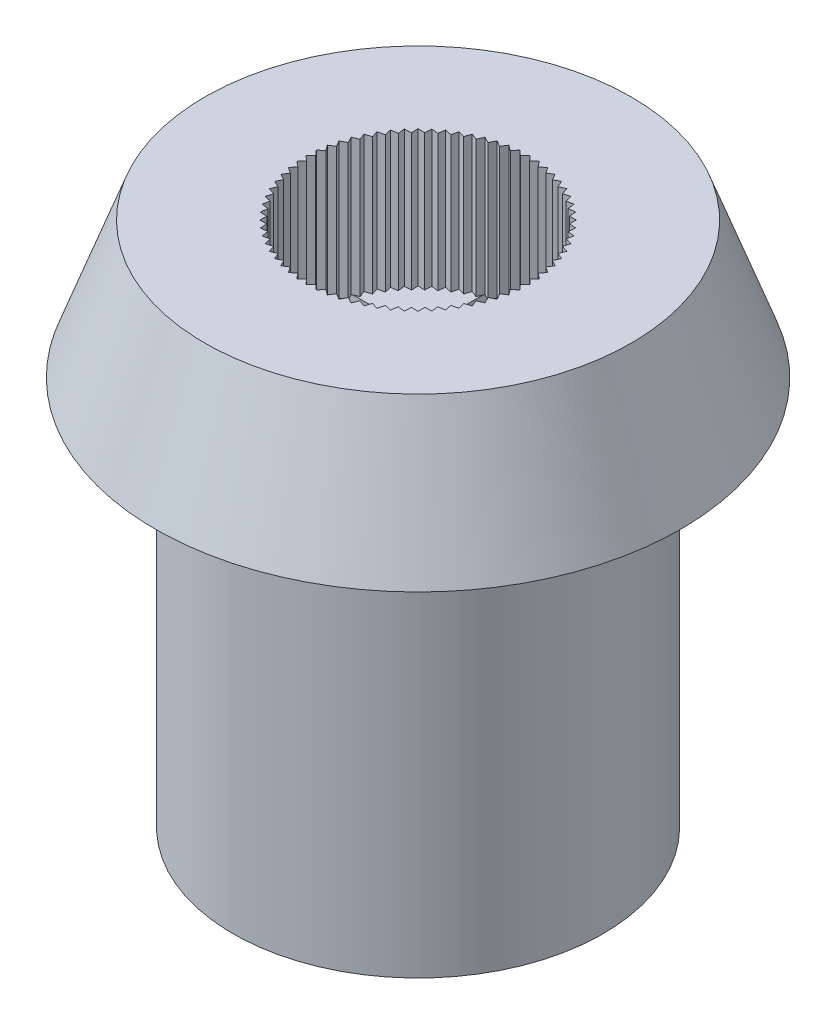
from build123d import *

# Parameters (mm, degrees)
AUFSATZ_LINEAR_AUSTRAGEN3_DEPTH = 2.8
SCHNITT_LINEAR_AUSTRAGEN1_DEPTH = 8


with BuildPart() as part:
    # Skizze1 → Rotation1 (revolve)
    with BuildSketch(Plane.XY, mode=Mode.PRIVATE) as rotation1_sk:
        Polygon((-2.3, 0), (-4.380883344, 0), (-5.4, -2.8), (-3.8, -2.8), (-3.8, -10.8), (0, -10.8), (0, -2.8), (-2.3, -2.8), align=None)
    revolve(rotation1_sk.sketch.rotate(Axis((0, 0, 0), (0, 1, 0)), 270), axis=Axis((0, 0, 0), (0, 1, 0)))

    # Skizze2 → Aufsatz-Linear austragen3 (add)
    with BuildSketch(Plane(origin=(0, 0, 0), x_dir=(1, 0, 0), z_dir=(0, 1, 0))):
        with BuildLine():
            Line((-2.181178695, -0.287157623), (-2.291247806, -0.200458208))
            ThreePointArc((-2.291247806, -0.200458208), (-2.280323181, -0.300210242), (-2.265057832, -0.399390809))
            Line((-2.265057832, -0.399390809), (-2.181178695, -0.287157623))
        make_face()
        with BuildLine():
            Line((-2.098177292, -0.661552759), (-2.2216294, -0.595283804))
            ThreePointArc((-2.2216294, -0.595283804), (-2.193548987, -0.691623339), (-2.161293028, -0.78664633))
            Line((-2.161293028, -0.78664633), (-2.098177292, -0.661552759))
        make_face()
        with BuildLine():
            Line((-2.032534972, -0.841903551), (-2.161293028, -0.78664633))
            ThreePointArc((-2.161293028, -0.78664633), (-2.124922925, -0.880171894), (-2.08450791, -0.972022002))
            Line((-2.08450791, -0.972022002), (-2.032534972, -0.841903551))
        make_face()
        with BuildLine():
            Line((-1.855461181, -1.182059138), (-1.991858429, -1.15))
            ThreePointArc((-1.991858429, -1.15), (-1.939800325, -1.235789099), (-1.884049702, -1.319225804))
            Line((-1.884049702, -1.319225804), (-1.855461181, -1.182059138))
        make_face()
        with BuildLine():
            Line((-1.745377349, -1.339275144), (-1.884049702, -1.319225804))
            ThreePointArc((-1.884049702, -1.319225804), (-1.824712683, -1.400151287), (-1.761902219, -1.478411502))
            Line((-1.761902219, -1.478411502), (-1.745377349, -1.339275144))
        make_face()
        with BuildLine():
            Line((-1.622010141, -1.486298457), (-1.761902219, -1.478411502))
            ThreePointArc((-1.761902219, -1.478411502), (-1.695737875, -1.553857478), (-1.626345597, -1.626345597))
            Line((-1.626345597, -1.626345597), (-1.622010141, -1.486298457))
        make_face()
        with BuildLine():
            Line((-1.339275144, -1.745377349), (-1.478411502, -1.761902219))
            ThreePointArc((-1.478411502, -1.761902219), (-1.400151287, -1.824712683), (-1.319225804, -1.884049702))
            Line((-1.319225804, -1.884049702), (-1.339275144, -1.745377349))
        make_face()
        with BuildLine():
            Line((-0.841903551, -2.032534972), (-0.972022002, -2.08450791))
            ThreePointArc((-0.972022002, -2.08450791), (-0.880171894, -2.124922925), (-0.78664633, -2.161293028))
            Line((-0.78664633, -2.161293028), (-0.841903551, -2.032534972))
        make_face()
        with BuildLine():
            Line((-0.661552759, -2.098177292), (-0.78664633, -2.161293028))
            ThreePointArc((-0.78664633, -2.161293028), (-0.691623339, -2.193548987), (-0.595283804, -2.2216294))
            Line((-0.595283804, -2.2216294), (-0.661552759, -2.098177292))
        make_face()
        with BuildLine():
            Line((-0.476167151, -2.147851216), (-0.595283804, -2.2216294))
            ThreePointArc((-0.595283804, -2.2216294), (-0.497811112, -2.245480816), (-0.399390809, -2.265057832))
            Line((-0.399390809, -2.265057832), (-0.476167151, -2.147851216))
        make_face()
        with BuildLine():
            Line((-0.287157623, -2.181178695), (-0.399390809, -2.265057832))
            ThreePointArc((-0.399390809, -2.265057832), (-0.300210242, -2.280323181), (-0.200458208, -2.291247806))
            Line((-0.200458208, -2.291247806), (-0.287157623, -2.181178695))
        make_face()
        with BuildLine():
            Line((-0.095962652, -2.197906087), (-0.200458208, -2.291247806))
            ThreePointArc((-0.200458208, -2.291247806), (-0.100324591, -2.29781091), (0, -2.3))
            Line((0, -2.3), (-0.095962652, -2.197906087))
        make_face()
        with BuildLine():
            Line((0.095962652, -2.197906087), (0, -2.3))
            ThreePointArc((0, -2.3), (0.100324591, -2.29781091), (0.200458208, -2.291247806))
            Line((0.200458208, -2.291247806), (0.095962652, -2.197906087))
        make_face()
        with BuildLine():
            Line((0.287157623, -2.181178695), (0.200458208, -2.291247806))
            ThreePointArc((0.200458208, -2.291247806), (0.300210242, -2.280323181), (0.399390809, -2.265057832))
            Line((0.399390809, -2.265057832), (0.287157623, -2.181178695))
        make_face()
        with BuildLine():
            Line((0.476167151, -2.147851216), (0.399390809, -2.265057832))
            ThreePointArc((0.399390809, -2.265057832), (0.497811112, -2.245480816), (0.595283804, -2.2216294))
            Line((0.595283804, -2.2216294), (0.476167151, -2.147851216))
        make_face()
        with BuildLine():
            Line((0.661552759, -2.098177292), (0.595283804, -2.2216294))
            ThreePointArc((0.595283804, -2.2216294), (0.691623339, -2.193548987), (0.78664633, -2.161293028))
            Line((0.78664633, -2.161293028), (0.661552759, -2.098177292))
        make_face()
        with BuildLine():
            Line((0.841903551, -2.032534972), (0.78664633, -2.161293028))
            ThreePointArc((0.78664633, -2.161293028), (0.880171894, -2.124922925), (0.972022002, -2.08450791))
            Line((0.972022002, -2.08450791), (0.841903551, -2.032534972))
        make_face()
        with BuildLine():
            Line((1.015846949, -1.951423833), (0.972022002, -2.08450791))
            ThreePointArc((0.972022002, -2.08450791), (1.06202181, -2.040124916), (1.15, -1.991858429))
            Line((1.15, -1.991858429), (1.015846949, -1.951423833))
        make_face()
        with BuildLine():
            Line((1.182059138, -1.855461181), (1.15, -1.991858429))
            ThreePointArc((1.15, -1.991858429), (1.235789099, -1.939800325), (1.319225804, -1.884049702))
            Line((1.319225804, -1.884049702), (1.182059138, -1.855461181))
        make_face()
        with BuildLine():
            Line((1.486298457, -1.622010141), (1.478411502, -1.761902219))
            ThreePointArc((1.478411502, -1.761902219), (1.553857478, -1.695737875), (1.626345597, -1.626345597))
            Line((1.626345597, -1.626345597), (1.486298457, -1.622010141))
        make_face()
        with BuildLine():
            Line((1.622010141, -1.486298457), (1.626345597, -1.626345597))
            ThreePointArc((1.626345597, -1.626345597), (1.695737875, -1.553857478), (1.761902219, -1.478411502))
            Line((1.761902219, -1.478411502), (1.622010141, -1.486298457))
        make_face()
        with BuildLine():
            Line((1.855461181, -1.182059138), (1.884049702, -1.319225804))
            ThreePointArc((1.884049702, -1.319225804), (1.939800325, -1.235789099), (1.991858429, -1.15))
            Line((1.991858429, -1.15), (1.855461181, -1.182059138))
        make_face()
        with BuildLine():
            Line((1.951423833, -1.015846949), (1.991858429, -1.15))
            ThreePointArc((1.991858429, -1.15), (2.040124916, -1.06202181), (2.08450791, -0.972022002))
            Line((2.08450791, -0.972022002), (1.951423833, -1.015846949))
        make_face()
        with BuildLine():
            Line((2.032534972, -0.841903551), (2.08450791, -0.972022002))
            ThreePointArc((2.08450791, -0.972022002), (2.124922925, -0.880171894), (2.161293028, -0.78664633))
            Line((2.161293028, -0.78664633), (2.032534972, -0.841903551))
        make_face()
        with BuildLine():
            Line((2.098177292, -0.661552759), (2.161293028, -0.78664633))
            ThreePointArc((2.161293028, -0.78664633), (2.193548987, -0.691623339), (2.2216294, -0.595283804))
            Line((2.2216294, -0.595283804), (2.098177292, -0.661552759))
        make_face()
        with BuildLine():
            Line((2.147851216, -0.476167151), (2.2216294, -0.595283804))
            ThreePointArc((2.2216294, -0.595283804), (2.245480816, -0.497811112), (2.265057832, -0.399390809))
            Line((2.265057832, -0.399390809), (2.147851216, -0.476167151))
        make_face()
        with BuildLine():
            Line((2.181178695, -0.287157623), (2.265057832, -0.399390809))
            ThreePointArc((2.265057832, -0.399390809), (2.280323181, -0.300210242), (2.291247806, -0.200458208))
            Line((2.291247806, -0.200458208), (2.181178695, -0.287157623))
        make_face()
        with BuildLine():
            ThreePointArc((2.291247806, -0.200458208), (2.29781091, -0.100324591), (2.3, 0))
            Line((2.3, 0), (2.197906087, -0.095962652))
            Line((2.197906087, -0.095962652), (2.291247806, -0.200458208))
        make_face()
        with BuildLine():
            ThreePointArc((2.3, 0), (2.29781091, 0.100324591), (2.291247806, 0.200458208))
            Line((2.291247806, 0.200458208), (2.197906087, 0.095962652))
            Line((2.197906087, 0.095962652), (2.3, 0))
        make_face()
        with BuildLine():
            ThreePointArc((2.265057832, 0.399390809), (2.245480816, 0.497811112), (2.2216294, 0.595283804))
            Line((2.2216294, 0.595283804), (2.147851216, 0.476167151))
            Line((2.147851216, 0.476167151), (2.265057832, 0.399390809))
        make_face()
        with BuildLine():
            ThreePointArc((2.161293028, 0.78664633), (2.124922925, 0.880171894), (2.08450791, 0.972022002))
            Line((2.08450791, 0.972022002), (2.032534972, 0.841903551))
            Line((2.032534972, 0.841903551), (2.161293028, 0.78664633))
        make_face()
        with BuildLine():
            ThreePointArc((1.761902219, 1.478411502), (1.695737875, 1.553857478), (1.626345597, 1.626345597))
            Line((1.626345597, 1.626345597), (1.622010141, 1.486298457))
            Line((1.622010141, 1.486298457), (1.761902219, 1.478411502))
        make_face()
        with BuildLine():
            ThreePointArc((1.626345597, 1.626345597), (1.553857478, 1.695737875), (1.478411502, 1.761902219))
            Line((1.478411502, 1.761902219), (1.486298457, 1.622010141))
            Line((1.486298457, 1.622010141), (1.626345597, 1.626345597))
        make_face()
        with BuildLine():
            ThreePointArc((0.972022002, 2.08450791), (0.880171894, 2.124922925), (0.78664633, 2.161293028))
            Line((0.78664633, 2.161293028), (0.841903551, 2.032534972))
            Line((0.841903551, 2.032534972), (0.972022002, 2.08450791))
        make_face()
        with BuildLine():
            ThreePointArc((0.78664633, 2.161293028), (0.691623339, 2.193548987), (0.595283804, 2.2216294))
            Line((0.595283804, 2.2216294), (0.661552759, 2.098177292))
            Line((0.661552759, 2.098177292), (0.78664633, 2.161293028))
        make_face()
        with BuildLine():
            ThreePointArc((0.595283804, 2.2216294), (0.497811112, 2.245480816), (0.399390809, 2.265057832))
            Line((0.399390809, 2.265057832), (0.476167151, 2.147851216))
            Line((0.476167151, 2.147851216), (0.595283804, 2.2216294))
        make_face()
        with BuildLine():
            ThreePointArc((0.399390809, 2.265057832), (0.300210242, 2.280323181), (0.200458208, 2.291247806))
            Line((0.200458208, 2.291247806), (0.287157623, 2.181178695))
            Line((0.287157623, 2.181178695), (0.399390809, 2.265057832))
        make_face()
        with BuildLine():
            ThreePointArc((0.200458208, 2.291247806), (0.100324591, 2.29781091), (0, 2.3))
            Line((0, 2.3), (0.095962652, 2.197906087))
            Line((0.095962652, 2.197906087), (0.200458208, 2.291247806))
        make_face()
        with BuildLine():
            ThreePointArc((0, 2.3), (-0.100324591, 2.29781091), (-0.200458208, 2.291247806))
            Line((-0.200458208, 2.291247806), (-0.095962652, 2.197906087))
            Line((-0.095962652, 2.197906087), (0, 2.3))
        make_face()
        with BuildLine():
            ThreePointArc((-0.200458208, 2.291247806), (-0.300210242, 2.280323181), (-0.399390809, 2.265057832))
            Line((-0.399390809, 2.265057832), (-0.287157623, 2.181178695))
            Line((-0.287157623, 2.181178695), (-0.200458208, 2.291247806))
        make_face()
        with BuildLine():
            ThreePointArc((-2.2216294, 0.595283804), (-2.245480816, 0.497811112), (-2.265057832, 0.399390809))
            Line((-2.265057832, 0.399390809), (-2.147851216, 0.476167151))
            Line((-2.147851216, 0.476167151), (-2.2216294, 0.595283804))
        make_face()
        with BuildLine():
            ThreePointArc((-2.161293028, 0.78664633), (-2.193548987, 0.691623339), (-2.2216294, 0.595283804))
            Line((-2.2216294, 0.595283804), (-2.098177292, 0.661552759))
            Line((-2.098177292, 0.661552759), (-2.161293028, 0.78664633))
        make_face()
        with BuildLine():
            ThreePointArc((-2.08450791, 0.972022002), (-2.124922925, 0.880171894), (-2.161293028, 0.78664633))
            Line((-2.161293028, 0.78664633), (-2.032534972, 0.841903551))
            Line((-2.032534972, 0.841903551), (-2.08450791, 0.972022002))
        make_face()
        with BuildLine():
            ThreePointArc((-1.478411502, 1.761902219), (-1.553857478, 1.695737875), (-1.626345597, 1.626345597))
            Line((-1.626345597, 1.626345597), (-1.486298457, 1.622010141))
            Line((-1.486298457, 1.622010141), (-1.478411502, 1.761902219))
        make_face()
        with BuildLine():
            ThreePointArc((-1.319225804, 1.884049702), (-1.400151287, 1.824712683), (-1.478411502, 1.761902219))
            Line((-1.478411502, 1.761902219), (-1.339275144, 1.745377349))
            Line((-1.339275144, 1.745377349), (-1.319225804, 1.884049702))
        make_face()
        with BuildLine():
            ThreePointArc((-1.15, 1.991858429), (-1.235789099, 1.939800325), (-1.319225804, 1.884049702))
            Line((-1.319225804, 1.884049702), (-1.182059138, 1.855461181))
            Line((-1.182059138, 1.855461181), (-1.15, 1.991858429))
        make_face()
        with BuildLine():
            ThreePointArc((-0.78664633, 2.161293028), (-0.880171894, 2.124922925), (-0.972022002, 2.08450791))
            Line((-0.972022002, 2.08450791), (-0.841903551, 2.032534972))
            Line((-0.841903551, 2.032534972), (-0.78664633, 2.161293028))
        make_face()
        with BuildLine():
            ThreePointArc((-0.595283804, 2.2216294), (-0.691623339, 2.193548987), (-0.78664633, 2.161293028))
            Line((-0.78664633, 2.161293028), (-0.661552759, 2.098177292))
            Line((-0.661552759, 2.098177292), (-0.595283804, 2.2216294))
        make_face()
        with BuildLine():
            ThreePointArc((-0.399390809, 2.265057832), (-0.497811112, 2.245480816), (-0.595283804, 2.2216294))
            Line((-0.595283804, 2.2216294), (-0.476167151, 2.147851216))
            Line((-0.476167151, 2.147851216), (-0.399390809, 2.265057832))
        make_face()
        with BuildLine():
            Line((-2.181178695, 0.287157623), (-2.291247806, 0.200458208))
            ThreePointArc((-2.291247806, 0.200458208), (-2.280323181, 0.300210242), (-2.265057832, 0.399390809))
            Line((-2.265057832, 0.399390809), (-2.181178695, 0.287157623))
        make_face()
        with BuildLine():
            ThreePointArc((-2.291247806, 0.200458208), (-2.29781091, 0.100324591), (-2.3, 0))
            Line((-2.3, 0), (-2.197906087, 0.095962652))
            Line((-2.197906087, 0.095962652), (-2.291247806, 0.200458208))
        make_face()
        with BuildLine():
            ThreePointArc((-2.3, 0), (-2.29781091, -0.100324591), (-2.291247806, -0.200458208))
            Line((-2.291247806, -0.200458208), (-2.197906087, -0.095962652))
            Line((-2.197906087, -0.095962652), (-2.3, 0))
        make_face()
        with BuildLine():
            ThreePointArc((-2.265057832, -0.399390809), (-2.245480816, -0.497811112), (-2.2216294, -0.595283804))
            Line((-2.2216294, -0.595283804), (-2.147851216, -0.476167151))
            Line((-2.147851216, -0.476167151), (-2.265057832, -0.399390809))
        make_face()
        with BuildLine():
            Line((-2.08450791, -0.972022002), (-1.951423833, -1.015846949))
            Line((-1.951423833, -1.015846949), (-1.991858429, -1.15))
            ThreePointArc((-1.991858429, -1.15), (-2.040124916, -1.06202181), (-2.08450791, -0.972022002))
        make_face()
        with BuildLine():
            Line((-1.486298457, -1.622010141), (-1.478411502, -1.761902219))
            ThreePointArc((-1.478411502, -1.761902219), (-1.553857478, -1.695737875), (-1.626345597, -1.626345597))
            Line((-1.626345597, -1.626345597), (-1.486298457, -1.622010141))
        make_face()
        with BuildLine():
            Line((-1.182059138, -1.855461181), (-1.15, -1.991858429))
            ThreePointArc((-1.15, -1.991858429), (-1.235789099, -1.939800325), (-1.319225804, -1.884049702))
            Line((-1.319225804, -1.884049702), (-1.182059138, -1.855461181))
        make_face()
        with BuildLine():
            Line((-1.15, -1.991858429), (-1.015846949, -1.951423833))
            Line((-1.015846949, -1.951423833), (-0.972022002, -2.08450791))
            ThreePointArc((-0.972022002, -2.08450791), (-1.06202181, -2.040124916), (-1.15, -1.991858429))
        make_face()
        with BuildLine():
            Line((1.339275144, -1.745377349), (1.478411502, -1.761902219))
            ThreePointArc((1.478411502, -1.761902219), (1.400151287, -1.824712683), (1.319225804, -1.884049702))
            Line((1.319225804, -1.884049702), (1.339275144, -1.745377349))
        make_face()
        with BuildLine():
            Line((1.761902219, -1.478411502), (1.745377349, -1.339275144))
            Line((1.745377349, -1.339275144), (1.884049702, -1.319225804))
            ThreePointArc((1.884049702, -1.319225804), (1.824712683, -1.400151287), (1.761902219, -1.478411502))
        make_face()
        with BuildLine():
            ThreePointArc((2.291247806, 0.200458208), (2.280323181, 0.300210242), (2.265057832, 0.399390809))
            Line((2.265057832, 0.399390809), (2.181178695, 0.287157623))
            Line((2.181178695, 0.287157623), (2.291247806, 0.200458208))
        make_face()
        with BuildLine():
            Line((2.098177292, 0.661552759), (2.161293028, 0.78664633))
            ThreePointArc((2.161293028, 0.78664633), (2.193548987, 0.691623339), (2.2216294, 0.595283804))
            Line((2.2216294, 0.595283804), (2.098177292, 0.661552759))
        make_face()
        with BuildLine():
            Line((1.951423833, 1.015846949), (1.991858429, 1.15))
            ThreePointArc((1.991858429, 1.15), (2.040124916, 1.06202181), (2.08450791, 0.972022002))
            Line((2.08450791, 0.972022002), (1.951423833, 1.015846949))
        make_face()
        with BuildLine():
            Line((1.855461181, 1.182059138), (1.884049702, 1.319225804))
            ThreePointArc((1.884049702, 1.319225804), (1.939800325, 1.235789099), (1.991858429, 1.15))
            Line((1.991858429, 1.15), (1.855461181, 1.182059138))
        make_face()
        with BuildLine():
            Line((1.745377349, 1.339275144), (1.761902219, 1.478411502))
            ThreePointArc((1.761902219, 1.478411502), (1.824712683, 1.400151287), (1.884049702, 1.319225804))
            Line((1.884049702, 1.319225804), (1.745377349, 1.339275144))
        make_face()
        with BuildLine():
            Line((1.478411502, 1.761902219), (1.339275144, 1.745377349))
            Line((1.339275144, 1.745377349), (1.319225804, 1.884049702))
            ThreePointArc((1.319225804, 1.884049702), (1.400151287, 1.824712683), (1.478411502, 1.761902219))
        make_face()
        with BuildLine():
            Line((1.182059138, 1.855461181), (1.15, 1.991858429))
            ThreePointArc((1.15, 1.991858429), (1.235789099, 1.939800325), (1.319225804, 1.884049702))
            Line((1.319225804, 1.884049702), (1.182059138, 1.855461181))
        make_face()
        with BuildLine():
            Line((1.15, 1.991858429), (1.015846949, 1.951423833))
            Line((1.015846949, 1.951423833), (0.972022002, 2.08450791))
            ThreePointArc((0.972022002, 2.08450791), (1.06202181, 2.040124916), (1.15, 1.991858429))
        make_face()
        with BuildLine():
            Line((-1.991858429, 1.15), (-1.951423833, 1.015846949))
            Line((-1.951423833, 1.015846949), (-2.08450791, 0.972022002))
            ThreePointArc((-2.08450791, 0.972022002), (-2.040124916, 1.06202181), (-1.991858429, 1.15))
        make_face()
        with BuildLine():
            Line((-1.855461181, 1.182059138), (-1.991858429, 1.15))
            ThreePointArc((-1.991858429, 1.15), (-1.939800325, 1.235789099), (-1.884049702, 1.319225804))
            Line((-1.884049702, 1.319225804), (-1.855461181, 1.182059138))
        make_face()
        with BuildLine():
            Line((-1.745377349, 1.339275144), (-1.884049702, 1.319225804))
            ThreePointArc((-1.884049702, 1.319225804), (-1.824712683, 1.400151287), (-1.761902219, 1.478411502))
            Line((-1.761902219, 1.478411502), (-1.745377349, 1.339275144))
        make_face()
        with BuildLine():
            Line((-1.622010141, 1.486298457), (-1.761902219, 1.478411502))
            ThreePointArc((-1.761902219, 1.478411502), (-1.695737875, 1.553857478), (-1.626345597, 1.626345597))
            Line((-1.626345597, 1.626345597), (-1.622010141, 1.486298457))
        make_face()
        with BuildLine():
            Line((-1.015846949, 1.951423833), (-1.15, 1.991858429))
            ThreePointArc((-1.15, 1.991858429), (-1.06202181, 2.040124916), (-0.972022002, 2.08450791))
            Line((-0.972022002, 2.08450791), (-1.015846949, 1.951423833))
        make_face()
    extrude(amount=-AUFSATZ_LINEAR_AUSTRAGEN3_DEPTH)

    # Skizze3 → Schnitt-Linear austragen1 (cut)
    with BuildSketch(Plane.XZ.offset(10.8)):
        with BuildLine():
            Line((0.8, 2.315707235), (0.8, 1.2))
            ThreePointArc((0.8, 1.2), (0.917157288, 0.917157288), (1.2, 0.8))
            Line((1.2, 0.8), (2.315707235, 0.8))
            ThreePointArc((2.315707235, 0.8), (2.45, 0), (2.315707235, -0.8))
            Line((2.315707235, -0.8), (1.2, -0.8))
            ThreePointArc((1.2, -0.8), (0.917157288, -0.917157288), (0.8, -1.2))
            Line((0.8, -1.2), (0.8, -2.315707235))
            ThreePointArc((0.8, -2.315707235), (0, -2.45), (-0.8, -2.315707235))
            Line((-0.8, -2.315707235), (-0.8, -1.2))
            ThreePointArc((-0.8, -1.2), (-0.917157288, -0.917157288), (-1.2, -0.8))
            Line((-1.2, -0.8), (-2.315707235, -0.8))
            ThreePointArc((-2.315707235, -0.8), (-2.45, 0), (-2.315707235, 0.8))
            Line((-2.315707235, 0.8), (-1.2, 0.8))
            ThreePointArc((-1.2, 0.8), (-0.917157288, 0.917157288), (-0.8, 1.2))
            Line((-0.8, 1.2), (-0.8, 2.315707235))
            ThreePointArc((-0.8, 2.315707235), (0, 2.45), (0.8, 2.315707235))
        make_face()
    extrude(amount=-SCHNITT_LINEAR_AUSTRAGEN1_DEPTH, mode=Mode.SUBTRACT)


solid = part.part
